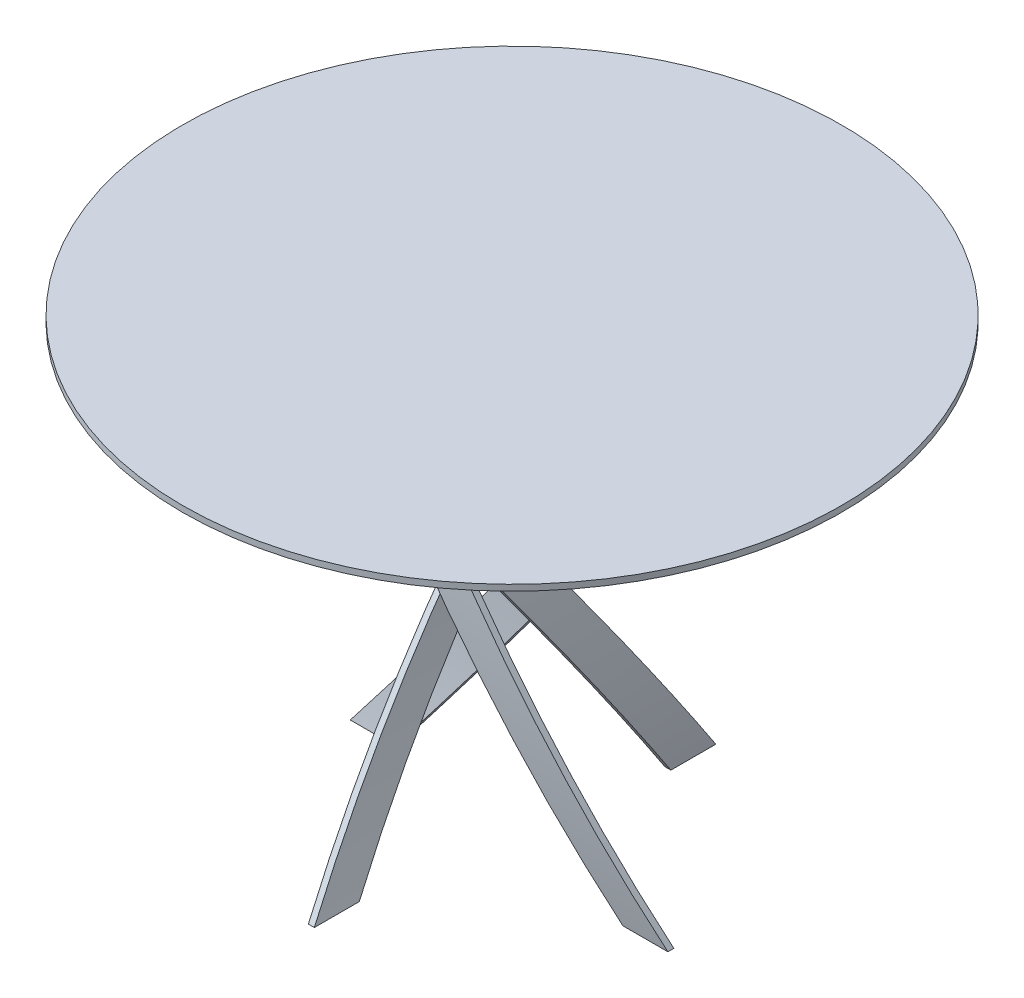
ISO-10303-21;
HEADER;
FILE_DESCRIPTION(('STEP AP214'),'2;1');
FILE_NAME('part.step','',(''),(''),'','','');
FILE_SCHEMA(('AUTOMOTIVE_DESIGN { 1 0 10303 214 1 1 1 1 }'));
ENDSEC;
DATA;
#1=APPLICATION_CONTEXT('core data for automotive mechanical design processes');
#2=APPLICATION_PROTOCOL_DEFINITION('international standard','automotive_design',2000,#1);
#3=PRODUCT_CONTEXT('',#1,'mechanical');
#4=PRODUCT('Part','Part','',(#3));
#5=PRODUCT_RELATED_PRODUCT_CATEGORY('part','',(#4));
#6=PRODUCT_DEFINITION_FORMATION('','',#4);
#7=PRODUCT_DEFINITION_CONTEXT('part definition',#1,'design');
#8=PRODUCT_DEFINITION('design','',#6,#7);
#9=PRODUCT_DEFINITION_SHAPE('','',#8);
#10=(LENGTH_UNIT() NAMED_UNIT(*) SI_UNIT(.MILLI.,.METRE.));
#11=(NAMED_UNIT(*) PLANE_ANGLE_UNIT() SI_UNIT($,.RADIAN.));
#12=(NAMED_UNIT(*) SI_UNIT($,.STERADIAN.) SOLID_ANGLE_UNIT());
#13=UNCERTAINTY_MEASURE_WITH_UNIT(LENGTH_MEASURE(1.E-05),#10,'distance_accuracy_value','');
#14=(GEOMETRIC_REPRESENTATION_CONTEXT(3) GLOBAL_UNCERTAINTY_ASSIGNED_CONTEXT((#13)) GLOBAL_UNIT_ASSIGNED_CONTEXT((#10,
#11,#12)) REPRESENTATION_CONTEXT('',''));
#15=CARTESIAN_POINT('',(0.,0.,0.));
#16=DIRECTION('',(0.,0.,1.));
#17=DIRECTION('',(1.,0.,0.));
#18=AXIS2_PLACEMENT_3D('',#15,#16,#17);
#19=CARTESIAN_POINT('',(-300.000000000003,-1.11022302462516E-13,299.999999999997));
#20=DIRECTION('',(0.,0.589469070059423,0.807790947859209));
#21=DIRECTION('',(0.,-0.807790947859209,0.589469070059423));
#22=AXIS2_PLACEMENT_3D('',#19,#20,#21);
#23=PLANE('',#22);
#24=DIRECTION('',(1.,0.,0.));
#25=VECTOR('',#24,1.);
#26=CARTESIAN_POINT('',(-299.999999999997,740.,-240.000000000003));
#27=LINE('',#26,#25);
#28=CARTESIAN_POINT('',(-39.9999999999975,740.,-240.));
#29=VERTEX_POINT('',#28);
#30=CARTESIAN_POINT('',(-29.9999999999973,740.,-240.));
#31=VERTEX_POINT('',#30);
#32=EDGE_CURVE('E109',#29,#31,#27,.T.);
#33=ORIENTED_EDGE('',*,*,#32,.F.);
#34=CARTESIAN_POINT('',(1721.56180703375,370.,30.0000000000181));
#35=DIRECTION('',(0.,0.589469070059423,0.807790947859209));
#36=DIRECTION('',(0.,0.807790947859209,-0.589469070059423));
#37=AXIS2_PLACEMENT_3D('',#34,#35,#36);
#38=ELLIPSE('',#37,2228.29929546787,1800.);
#39=CARTESIAN_POINT('',(-40.0000000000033,-1.11022302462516E-13,300.));
#40=VERTEX_POINT('',#39);
#41=EDGE_CURVE('E91',#29,#40,#38,.T.);
#42=ORIENTED_EDGE('',*,*,#41,.T.);
#43=DIRECTION('',(1.,0.,0.));
#44=VECTOR('',#43,1.);
#45=CARTESIAN_POINT('',(-300.000000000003,-1.11022302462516E-13,299.999999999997));
#46=LINE('',#45,#44);
#47=CARTESIAN_POINT('',(-30.0000000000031,-1.11022302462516E-13,300.));
#48=VERTEX_POINT('',#47);
#49=EDGE_CURVE('E111',#40,#48,#46,.T.);
#50=ORIENTED_EDGE('',*,*,#49,.T.);
#51=CARTESIAN_POINT('',(1731.56180703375,370.,30.0000000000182));
#52=DIRECTION('',(0.,0.589469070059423,0.807790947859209));
#53=DIRECTION('',(0.,0.807790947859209,-0.589469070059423));
#54=AXIS2_PLACEMENT_3D('',#51,#52,#53);
#55=ELLIPSE('',#54,2228.29929546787,1800.);
#56=EDGE_CURVE('E96',#48,#31,#55,.F.);
#57=ORIENTED_EDGE('',*,*,#56,.T.);
#58=EDGE_LOOP('',(#33,#42,#50,#57));
#59=FACE_BOUND('',#58,.T.);
#60=ADVANCED_FACE('F46',(#59),#23,.T.);
#61=CARTESIAN_POINT('',(1721.56180703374,370.,500.000000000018));
#62=DIRECTION('',(0.,0.,-1.));
#63=DIRECTION('',(-1.,0.,0.));
#64=AXIS2_PLACEMENT_3D('',#61,#62,#63);
#65=CYLINDRICAL_SURFACE('',#64,1800.);
#66=ORIENTED_EDGE('',*,*,#41,.F.);
#67=CARTESIAN_POINT('',(1721.56180703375,370.,-239.999999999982));
#68=DIRECTION('',(0.,0.,-1.));
#69=DIRECTION('',(0.,1.,0.));
#70=AXIS2_PLACEMENT_3D('',#67,#68,#69);
#71=CIRCLE('',#70,1800.);
#72=CARTESIAN_POINT('',(-58.4922044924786,637.222222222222,-240.000000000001));
#73=VERTEX_POINT('',#72);
#74=EDGE_CURVE('E87',#73,#29,#71,.T.);
#75=ORIENTED_EDGE('',*,*,#74,.F.);
#76=CARTESIAN_POINT('',(1721.56180703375,370.,-44.9999999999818));
#77=DIRECTION('',(0.,-0.589469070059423,-0.807790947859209));
#78=DIRECTION('',(0.,0.807790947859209,-0.589469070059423));
#79=AXIS2_PLACEMENT_3D('',#76,#77,#78);
#80=ELLIPSE('',#79,2228.29929546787,1800.);
#81=CARTESIAN_POINT('',(-40.0000000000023,-1.11022302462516E-13,225.));
#82=VERTEX_POINT('',#81);
#83=EDGE_CURVE('E50',#82,#73,#80,.T.);
#84=ORIENTED_EDGE('',*,*,#83,.F.);
#85=DIRECTION('',(0.,0.,-1.));
#86=VECTOR('',#85,1.);
#87=CARTESIAN_POINT('',(-40.0000000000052,0.,500.));
#88=LINE('',#87,#86);
#89=EDGE_CURVE('E70',#40,#82,#88,.T.);
#90=ORIENTED_EDGE('',*,*,#89,.F.);
#91=EDGE_LOOP('',(#66,#75,#84,#90));
#92=FACE_BOUND('',#91,.T.);
#93=ADVANCED_FACE('F89',(#92),#65,.T.);
#94=CARTESIAN_POINT('',(-299.999999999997,637.222222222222,-240.000000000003));
#95=DIRECTION('',(0.,-0.589469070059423,-0.807790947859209));
#96=DIRECTION('',(0.,0.807790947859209,-0.589469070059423));
#97=AXIS2_PLACEMENT_3D('',#94,#95,#96);
#98=PLANE('',#97);
#99=DIRECTION('',(1.,0.,0.));
#100=VECTOR('',#99,1.);
#101=CARTESIAN_POINT('',(-300.000000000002,-1.11022302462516E-13,224.999999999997));
#102=LINE('',#101,#100);
#103=CARTESIAN_POINT('',(-30.0000000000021,-1.11022302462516E-13,225.));
#104=VERTEX_POINT('',#103);
#105=EDGE_CURVE('E12',#82,#104,#102,.T.);
#106=ORIENTED_EDGE('',*,*,#105,.F.);
#107=ORIENTED_EDGE('',*,*,#83,.T.);
#108=DIRECTION('',(1.,0.,0.));
#109=VECTOR('',#108,1.);
#110=CARTESIAN_POINT('',(-299.999999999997,637.222222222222,-240.000000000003));
#111=LINE('',#110,#109);
#112=CARTESIAN_POINT('',(-48.4922044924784,637.222222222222,-240.));
#113=VERTEX_POINT('',#112);
#114=EDGE_CURVE('E55',#73,#113,#111,.T.);
#115=ORIENTED_EDGE('',*,*,#114,.T.);
#116=CARTESIAN_POINT('',(1731.56180703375,370.,-44.9999999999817));
#117=DIRECTION('',(0.,-0.589469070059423,-0.807790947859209));
#118=DIRECTION('',(0.,0.807790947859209,-0.589469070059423));
#119=AXIS2_PLACEMENT_3D('',#116,#117,#118);
#120=ELLIPSE('',#119,2228.29929546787,1800.);
#121=EDGE_CURVE('E101',#113,#104,#120,.F.);
#122=ORIENTED_EDGE('',*,*,#121,.T.);
#123=EDGE_LOOP('',(#106,#107,#115,#122));
#124=FACE_BOUND('',#123,.T.);
#125=ADVANCED_FACE('F48',(#124),#98,.T.);
#126=CARTESIAN_POINT('',(-299.999999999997,740.,-240.000000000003));
#127=DIRECTION('',(0.,0.,-1.));
#128=DIRECTION('',(0.,1.,0.));
#129=AXIS2_PLACEMENT_3D('',#126,#127,#128);
#130=PLANE('',#129);
#131=ORIENTED_EDGE('',*,*,#114,.F.);
#132=ORIENTED_EDGE('',*,*,#74,.T.);
#133=ORIENTED_EDGE('',*,*,#32,.T.);
#134=CARTESIAN_POINT('',(1731.56180703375,370.,-239.999999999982));
#135=DIRECTION('',(0.,0.,-1.));
#136=DIRECTION('',(0.,1.,0.));
#137=AXIS2_PLACEMENT_3D('',#134,#135,#136);
#138=CIRCLE('',#137,1800.);
#139=EDGE_CURVE('E97',#31,#113,#138,.F.);
#140=ORIENTED_EDGE('',*,*,#139,.T.);
#141=EDGE_LOOP('',(#131,#132,#133,#140));
#142=FACE_BOUND('',#141,.T.);
#143=ADVANCED_FACE('F102',(#142),#130,.T.);
#144=CARTESIAN_POINT('',(1731.56180703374,370.,500.000000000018));
#145=DIRECTION('',(0.,0.,-1.));
#146=DIRECTION('',(-1.,0.,0.));
#147=AXIS2_PLACEMENT_3D('',#144,#145,#146);
#148=CYLINDRICAL_SURFACE('',#147,1800.);
#149=ORIENTED_EDGE('',*,*,#56,.F.);
#150=DIRECTION('',(0.,0.,-1.));
#151=VECTOR('',#150,1.);
#152=CARTESIAN_POINT('',(-30.0000000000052,0.,500.));
#153=LINE('',#152,#151);
#154=EDGE_CURVE('E62',#48,#104,#153,.T.);
#155=ORIENTED_EDGE('',*,*,#154,.T.);
#156=ORIENTED_EDGE('',*,*,#121,.F.);
#157=ORIENTED_EDGE('',*,*,#139,.F.);
#158=EDGE_LOOP('',(#149,#155,#156,#157));
#159=FACE_BOUND('',#158,.T.);
#160=ADVANCED_FACE('F122',(#159),#148,.F.);
#161=CARTESIAN_POINT('',(-300.000000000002,-1.11022302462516E-13,224.999999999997));
#162=DIRECTION('',(0.,-1.,0.));
#163=DIRECTION('',(-1.,0.,0.));
#164=AXIS2_PLACEMENT_3D('',#161,#162,#163);
#165=PLANE('',#164);
#166=ORIENTED_EDGE('',*,*,#49,.F.);
#167=ORIENTED_EDGE('',*,*,#89,.T.);
#168=ORIENTED_EDGE('',*,*,#105,.T.);
#169=ORIENTED_EDGE('',*,*,#154,.F.);
#170=EDGE_LOOP('',(#166,#167,#168,#169));
#171=FACE_BOUND('',#170,.T.);
#172=ADVANCED_FACE('F119',(#171),#165,.T.);
#173=CLOSED_SHELL('',(#60,#93,#125,#143,#160,#172));
#174=MANIFOLD_SOLID_BREP('B2',#173);
#175=CARTESIAN_POINT('',(300.,-1.11022302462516E-13,300.));
#176=DIRECTION('',(0.807790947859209,0.589469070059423,0.));
#177=DIRECTION('',(0.589469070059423,-0.807790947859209,0.));
#178=AXIS2_PLACEMENT_3D('',#175,#176,#177);
#179=PLANE('',#178);
#180=DIRECTION('',(0.,0.,-1.));
#181=VECTOR('',#180,1.);
#182=CARTESIAN_POINT('',(-240.,740.,300.));
#183=LINE('',#182,#181);
#184=CARTESIAN_POINT('',(-240.,740.,40.));
#185=VERTEX_POINT('',#184);
#186=CARTESIAN_POINT('',(-240.,740.,29.9999999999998));
#187=VERTEX_POINT('',#186);
#188=EDGE_CURVE('E255',#185,#187,#183,.T.);
#189=ORIENTED_EDGE('',*,*,#188,.F.);
#190=CARTESIAN_POINT('',(30.,370.,-1721.56180703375));
#191=DIRECTION('',(0.807790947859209,0.589469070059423,0.));
#192=DIRECTION('',(-0.589469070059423,0.807790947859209,0.));
#193=AXIS2_PLACEMENT_3D('',#190,#191,#192);
#194=ELLIPSE('',#193,2228.29929546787,1800.);
#195=CARTESIAN_POINT('',(300.,-1.11022302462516E-13,40.0000000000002));
#196=VERTEX_POINT('',#195);
#197=EDGE_CURVE('E237',#185,#196,#194,.T.);
#198=ORIENTED_EDGE('',*,*,#197,.T.);
#199=DIRECTION('',(0.,0.,-1.));
#200=VECTOR('',#199,1.);
#201=CARTESIAN_POINT('',(300.,-1.11022302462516E-13,300.));
#202=LINE('',#201,#200);
#203=CARTESIAN_POINT('',(300.,-1.11022302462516E-13,30.));
#204=VERTEX_POINT('',#203);
#205=EDGE_CURVE('E257',#196,#204,#202,.T.);
#206=ORIENTED_EDGE('',*,*,#205,.T.);
#207=CARTESIAN_POINT('',(30.,370.,-1731.56180703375));
#208=DIRECTION('',(0.807790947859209,0.589469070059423,0.));
#209=DIRECTION('',(-0.589469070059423,0.807790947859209,0.));
#210=AXIS2_PLACEMENT_3D('',#207,#208,#209);
#211=ELLIPSE('',#210,2228.29929546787,1800.);
#212=EDGE_CURVE('E242',#204,#187,#211,.F.);
#213=ORIENTED_EDGE('',*,*,#212,.T.);
#214=EDGE_LOOP('',(#189,#198,#206,#213));
#215=FACE_BOUND('',#214,.T.);
#216=ADVANCED_FACE('F192',(#215),#179,.T.);
#217=CARTESIAN_POINT('',(500.,370.,-1721.56180703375));
#218=DIRECTION('',(-1.,0.,0.));
#219=DIRECTION('',(0.,0.,1.));
#220=AXIS2_PLACEMENT_3D('',#217,#218,#219);
#221=CYLINDRICAL_SURFACE('',#220,1800.);
#222=ORIENTED_EDGE('',*,*,#197,.F.);
#223=CARTESIAN_POINT('',(-240.,370.,-1721.56180703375));
#224=DIRECTION('',(-1.,0.,0.));
#225=DIRECTION('',(0.,1.,0.));
#226=AXIS2_PLACEMENT_3D('',#223,#224,#225);
#227=CIRCLE('',#226,1800.);
#228=CARTESIAN_POINT('',(-240.,637.222222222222,58.4922044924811));
#229=VERTEX_POINT('',#228);
#230=EDGE_CURVE('E233',#229,#185,#227,.T.);
#231=ORIENTED_EDGE('',*,*,#230,.F.);
#232=CARTESIAN_POINT('',(-44.9999999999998,370.,-1721.56180703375));
#233=DIRECTION('',(-0.807790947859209,-0.589469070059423,0.));
#234=DIRECTION('',(-0.589469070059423,0.807790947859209,0.));
#235=AXIS2_PLACEMENT_3D('',#232,#233,#234);
#236=ELLIPSE('',#235,2228.29929546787,1800.);
#237=CARTESIAN_POINT('',(225.,-1.11022302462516E-13,40.));
#238=VERTEX_POINT('',#237);
#239=EDGE_CURVE('E196',#238,#229,#236,.T.);
#240=ORIENTED_EDGE('',*,*,#239,.F.);
#241=DIRECTION('',(-1.,0.,0.));
#242=VECTOR('',#241,1.);
#243=CARTESIAN_POINT('',(500.,0.,40.));
#244=LINE('',#243,#242);
#245=EDGE_CURVE('E216',#196,#238,#244,.T.);
#246=ORIENTED_EDGE('',*,*,#245,.F.);
#247=EDGE_LOOP('',(#222,#231,#240,#246));
#248=FACE_BOUND('',#247,.T.);
#249=ADVANCED_FACE('F235',(#248),#221,.T.);
#250=CARTESIAN_POINT('',(-240.,637.222222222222,300.));
#251=DIRECTION('',(-0.807790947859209,-0.589469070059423,0.));
#252=DIRECTION('',(-0.589469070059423,0.807790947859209,0.));
#253=AXIS2_PLACEMENT_3D('',#250,#251,#252);
#254=PLANE('',#253);
#255=DIRECTION('',(0.,0.,-1.));
#256=VECTOR('',#255,1.);
#257=CARTESIAN_POINT('',(225.,-1.11022302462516E-13,300.));
#258=LINE('',#257,#256);
#259=CARTESIAN_POINT('',(225.,-1.11022302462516E-13,29.9999999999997));
#260=VERTEX_POINT('',#259);
#261=EDGE_CURVE('E44',#238,#260,#258,.T.);
#262=ORIENTED_EDGE('',*,*,#261,.F.);
#263=ORIENTED_EDGE('',*,*,#239,.T.);
#264=DIRECTION('',(0.,0.,-1.));
#265=VECTOR('',#264,1.);
#266=CARTESIAN_POINT('',(-240.,637.222222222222,300.));
#267=LINE('',#266,#265);
#268=CARTESIAN_POINT('',(-240.,637.222222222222,48.4922044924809));
#269=VERTEX_POINT('',#268);
#270=EDGE_CURVE('E201',#229,#269,#267,.T.);
#271=ORIENTED_EDGE('',*,*,#270,.T.);
#272=CARTESIAN_POINT('',(-44.9999999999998,370.,-1731.56180703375));
#273=DIRECTION('',(-0.807790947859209,-0.589469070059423,0.));
#274=DIRECTION('',(-0.589469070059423,0.807790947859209,0.));
#275=AXIS2_PLACEMENT_3D('',#272,#273,#274);
#276=ELLIPSE('',#275,2228.29929546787,1800.);
#277=EDGE_CURVE('E247',#269,#260,#276,.F.);
#278=ORIENTED_EDGE('',*,*,#277,.T.);
#279=EDGE_LOOP('',(#262,#263,#271,#278));
#280=FACE_BOUND('',#279,.T.);
#281=ADVANCED_FACE('F194',(#280),#254,.T.);
#282=CARTESIAN_POINT('',(-240.,740.,300.));
#283=DIRECTION('',(-1.,0.,0.));
#284=DIRECTION('',(0.,1.,0.));
#285=AXIS2_PLACEMENT_3D('',#282,#283,#284);
#286=PLANE('',#285);
#287=ORIENTED_EDGE('',*,*,#270,.F.);
#288=ORIENTED_EDGE('',*,*,#230,.T.);
#289=ORIENTED_EDGE('',*,*,#188,.T.);
#290=CARTESIAN_POINT('',(-240.,370.,-1731.56180703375));
#291=DIRECTION('',(-1.,0.,0.));
#292=DIRECTION('',(0.,1.,0.));
#293=AXIS2_PLACEMENT_3D('',#290,#291,#292);
#294=CIRCLE('',#293,1800.);
#295=EDGE_CURVE('E243',#187,#269,#294,.F.);
#296=ORIENTED_EDGE('',*,*,#295,.T.);
#297=EDGE_LOOP('',(#287,#288,#289,#296));
#298=FACE_BOUND('',#297,.T.);
#299=ADVANCED_FACE('F248',(#298),#286,.T.);
#300=CARTESIAN_POINT('',(500.,370.,-1731.56180703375));
#301=DIRECTION('',(-1.,0.,0.));
#302=DIRECTION('',(0.,0.,1.));
#303=AXIS2_PLACEMENT_3D('',#300,#301,#302);
#304=CYLINDRICAL_SURFACE('',#303,1800.);
#305=ORIENTED_EDGE('',*,*,#212,.F.);
#306=DIRECTION('',(-1.,0.,0.));
#307=VECTOR('',#306,1.);
#308=CARTESIAN_POINT('',(500.,0.,30.));
#309=LINE('',#308,#307);
#310=EDGE_CURVE('E208',#204,#260,#309,.T.);
#311=ORIENTED_EDGE('',*,*,#310,.T.);
#312=ORIENTED_EDGE('',*,*,#277,.F.);
#313=ORIENTED_EDGE('',*,*,#295,.F.);
#314=EDGE_LOOP('',(#305,#311,#312,#313));
#315=FACE_BOUND('',#314,.T.);
#316=ADVANCED_FACE('F268',(#315),#304,.F.);
#317=CARTESIAN_POINT('',(225.,-1.11022302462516E-13,300.));
#318=DIRECTION('',(0.,-1.,0.));
#319=DIRECTION('',(0.,0.,1.));
#320=AXIS2_PLACEMENT_3D('',#317,#318,#319);
#321=PLANE('',#320);
#322=ORIENTED_EDGE('',*,*,#205,.F.);
#323=ORIENTED_EDGE('',*,*,#245,.T.);
#324=ORIENTED_EDGE('',*,*,#261,.T.);
#325=ORIENTED_EDGE('',*,*,#310,.F.);
#326=EDGE_LOOP('',(#322,#323,#324,#325));
#327=FACE_BOUND('',#326,.T.);
#328=ADVANCED_FACE('F265',(#327),#321,.T.);
#329=CLOSED_SHELL('',(#216,#249,#281,#299,#316,#328));
#330=MANIFOLD_SOLID_BREP('B6',#329);
#331=CARTESIAN_POINT('',(300.000000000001,-1.11022302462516E-13,-299.999999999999));
#332=DIRECTION('',(0.,0.589469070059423,-0.807790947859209));
#333=DIRECTION('',(0.,-0.807790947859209,-0.589469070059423));
#334=AXIS2_PLACEMENT_3D('',#331,#332,#333);
#335=PLANE('',#334);
#336=DIRECTION('',(-1.,0.,0.));
#337=VECTOR('',#336,1.);
#338=CARTESIAN_POINT('',(299.999999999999,740.,240.000000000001));
#339=LINE('',#338,#337);
#340=CARTESIAN_POINT('',(39.9999999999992,740.,240.));
#341=VERTEX_POINT('',#340);
#342=CARTESIAN_POINT('',(29.999999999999,740.,240.));
#343=VERTEX_POINT('',#342);
#344=EDGE_CURVE('E401',#341,#343,#339,.T.);
#345=ORIENTED_EDGE('',*,*,#344,.F.);
#346=CARTESIAN_POINT('',(-1721.56180703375,370.,-30.000000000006));
#347=DIRECTION('',(0.,0.589469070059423,-0.807790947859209));
#348=DIRECTION('',(0.,0.807790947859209,0.589469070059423));
#349=AXIS2_PLACEMENT_3D('',#346,#347,#348);
#350=ELLIPSE('',#349,2228.29929546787,1800.);
#351=CARTESIAN_POINT('',(40.0000000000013,-1.11022302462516E-13,-300.));
#352=VERTEX_POINT('',#351);
#353=EDGE_CURVE('E383',#341,#352,#350,.T.);
#354=ORIENTED_EDGE('',*,*,#353,.T.);
#355=DIRECTION('',(-1.,0.,0.));
#356=VECTOR('',#355,1.);
#357=CARTESIAN_POINT('',(300.000000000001,-1.11022302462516E-13,-299.999999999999));
#358=LINE('',#357,#356);
#359=CARTESIAN_POINT('',(30.000000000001,-1.11022302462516E-13,-300.));
#360=VERTEX_POINT('',#359);
#361=EDGE_CURVE('E403',#352,#360,#358,.T.);
#362=ORIENTED_EDGE('',*,*,#361,.T.);
#363=CARTESIAN_POINT('',(-1731.56180703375,370.,-30.0000000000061));
#364=DIRECTION('',(0.,0.589469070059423,-0.807790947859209));
#365=DIRECTION('',(0.,0.807790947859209,0.589469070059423));
#366=AXIS2_PLACEMENT_3D('',#363,#364,#365);
#367=ELLIPSE('',#366,2228.29929546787,1800.);
#368=EDGE_CURVE('E388',#360,#343,#367,.F.);
#369=ORIENTED_EDGE('',*,*,#368,.T.);
#370=EDGE_LOOP('',(#345,#354,#362,#369));
#371=FACE_BOUND('',#370,.T.);
#372=ADVANCED_FACE('F338',(#371),#335,.T.);
#373=CARTESIAN_POINT('',(-1721.56180703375,370.,-500.000000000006));
#374=DIRECTION('',(0.,0.,1.));
#375=DIRECTION('',(1.,0.,0.));
#376=AXIS2_PLACEMENT_3D('',#373,#374,#375);
#377=CYLINDRICAL_SURFACE('',#376,1800.);
#378=ORIENTED_EDGE('',*,*,#353,.F.);
#379=CARTESIAN_POINT('',(-1721.56180703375,370.,239.999999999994));
#380=DIRECTION('',(0.,0.,1.));
#381=DIRECTION('',(0.,1.,0.));
#382=AXIS2_PLACEMENT_3D('',#379,#380,#381);
#383=CIRCLE('',#382,1800.);
#384=CARTESIAN_POINT('',(58.4922044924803,637.222222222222,240.));
#385=VERTEX_POINT('',#384);
#386=EDGE_CURVE('E379',#385,#341,#383,.T.);
#387=ORIENTED_EDGE('',*,*,#386,.F.);
#388=CARTESIAN_POINT('',(-1721.56180703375,370.,44.9999999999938));
#389=DIRECTION('',(0.,-0.589469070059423,0.807790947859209));
#390=DIRECTION('',(0.,0.807790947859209,0.589469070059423));
#391=AXIS2_PLACEMENT_3D('',#388,#389,#390);
#392=ELLIPSE('',#391,2228.29929546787,1800.);
#393=CARTESIAN_POINT('',(40.0000000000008,-1.11022302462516E-13,-225.));
#394=VERTEX_POINT('',#393);
#395=EDGE_CURVE('E342',#394,#385,#392,.T.);
#396=ORIENTED_EDGE('',*,*,#395,.F.);
#397=DIRECTION('',(0.,0.,1.));
#398=VECTOR('',#397,1.);
#399=CARTESIAN_POINT('',(40.0000000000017,0.,-500.));
#400=LINE('',#399,#398);
#401=EDGE_CURVE('E362',#352,#394,#400,.T.);
#402=ORIENTED_EDGE('',*,*,#401,.F.);
#403=EDGE_LOOP('',(#378,#387,#396,#402));
#404=FACE_BOUND('',#403,.T.);
#405=ADVANCED_FACE('F381',(#404),#377,.T.);
#406=CARTESIAN_POINT('',(299.999999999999,637.222222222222,240.000000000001));
#407=DIRECTION('',(0.,-0.589469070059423,0.807790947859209));
#408=DIRECTION('',(0.,0.807790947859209,0.589469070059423));
#409=AXIS2_PLACEMENT_3D('',#406,#407,#408);
#410=PLANE('',#409);
#411=DIRECTION('',(-1.,0.,0.));
#412=VECTOR('',#411,1.);
#413=CARTESIAN_POINT('',(300.000000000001,-1.11022302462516E-13,-224.999999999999));
#414=LINE('',#413,#412);
#415=CARTESIAN_POINT('',(30.0000000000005,-1.11022302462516E-13,-225.));
#416=VERTEX_POINT('',#415);
#417=EDGE_CURVE('E190',#394,#416,#414,.T.);
#418=ORIENTED_EDGE('',*,*,#417,.F.);
#419=ORIENTED_EDGE('',*,*,#395,.T.);
#420=DIRECTION('',(-1.,0.,0.));
#421=VECTOR('',#420,1.);
#422=CARTESIAN_POINT('',(299.999999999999,637.222222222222,240.000000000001));
#423=LINE('',#422,#421);
#424=CARTESIAN_POINT('',(48.49220449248,637.222222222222,240.));
#425=VERTEX_POINT('',#424);
#426=EDGE_CURVE('E347',#385,#425,#423,.T.);
#427=ORIENTED_EDGE('',*,*,#426,.T.);
#428=CARTESIAN_POINT('',(-1731.56180703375,370.,44.9999999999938));
#429=DIRECTION('',(0.,-0.589469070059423,0.807790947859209));
#430=DIRECTION('',(0.,0.807790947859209,0.589469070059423));
#431=AXIS2_PLACEMENT_3D('',#428,#429,#430);
#432=ELLIPSE('',#431,2228.29929546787,1800.);
#433=EDGE_CURVE('E393',#425,#416,#432,.F.);
#434=ORIENTED_EDGE('',*,*,#433,.T.);
#435=EDGE_LOOP('',(#418,#419,#427,#434));
#436=FACE_BOUND('',#435,.T.);
#437=ADVANCED_FACE('F340',(#436),#410,.T.);
#438=CARTESIAN_POINT('',(299.999999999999,740.,240.000000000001));
#439=DIRECTION('',(0.,0.,1.));
#440=DIRECTION('',(0.,1.,0.));
#441=AXIS2_PLACEMENT_3D('',#438,#439,#440);
#442=PLANE('',#441);
#443=ORIENTED_EDGE('',*,*,#426,.F.);
#444=ORIENTED_EDGE('',*,*,#386,.T.);
#445=ORIENTED_EDGE('',*,*,#344,.T.);
#446=CARTESIAN_POINT('',(-1731.56180703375,370.,239.999999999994));
#447=DIRECTION('',(0.,0.,1.));
#448=DIRECTION('',(0.,1.,0.));
#449=AXIS2_PLACEMENT_3D('',#446,#447,#448);
#450=CIRCLE('',#449,1800.);
#451=EDGE_CURVE('E389',#343,#425,#450,.F.);
#452=ORIENTED_EDGE('',*,*,#451,.T.);
#453=EDGE_LOOP('',(#443,#444,#445,#452));
#454=FACE_BOUND('',#453,.T.);
#455=ADVANCED_FACE('F394',(#454),#442,.T.);
#456=CARTESIAN_POINT('',(-1731.56180703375,370.,-500.000000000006));
#457=DIRECTION('',(0.,0.,1.));
#458=DIRECTION('',(1.,0.,0.));
#459=AXIS2_PLACEMENT_3D('',#456,#457,#458);
#460=CYLINDRICAL_SURFACE('',#459,1800.);
#461=ORIENTED_EDGE('',*,*,#368,.F.);
#462=DIRECTION('',(0.,0.,1.));
#463=VECTOR('',#462,1.);
#464=CARTESIAN_POINT('',(30.0000000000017,0.,-500.));
#465=LINE('',#464,#463);
#466=EDGE_CURVE('E354',#360,#416,#465,.T.);
#467=ORIENTED_EDGE('',*,*,#466,.T.);
#468=ORIENTED_EDGE('',*,*,#433,.F.);
#469=ORIENTED_EDGE('',*,*,#451,.F.);
#470=EDGE_LOOP('',(#461,#467,#468,#469));
#471=FACE_BOUND('',#470,.T.);
#472=ADVANCED_FACE('F414',(#471),#460,.F.);
#473=CARTESIAN_POINT('',(300.000000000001,-1.11022302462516E-13,-224.999999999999));
#474=DIRECTION('',(0.,-1.,0.));
#475=DIRECTION('',(1.,0.,0.));
#476=AXIS2_PLACEMENT_3D('',#473,#474,#475);
#477=PLANE('',#476);
#478=ORIENTED_EDGE('',*,*,#361,.F.);
#479=ORIENTED_EDGE('',*,*,#401,.T.);
#480=ORIENTED_EDGE('',*,*,#417,.T.);
#481=ORIENTED_EDGE('',*,*,#466,.F.);
#482=EDGE_LOOP('',(#478,#479,#480,#481));
#483=FACE_BOUND('',#482,.T.);
#484=ADVANCED_FACE('F411',(#483),#477,.T.);
#485=CLOSED_SHELL('',(#372,#405,#437,#455,#472,#484));
#486=MANIFOLD_SOLID_BREP('B38',#485);
#487=CARTESIAN_POINT('',(-300.,-1.11022302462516E-13,-300.));
#488=DIRECTION('',(-0.807790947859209,0.589469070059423,0.));
#489=DIRECTION('',(-0.589469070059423,-0.807790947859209,0.));
#490=AXIS2_PLACEMENT_3D('',#487,#488,#489);
#491=PLANE('',#490);
#492=DIRECTION('',(0.,0.,1.));
#493=VECTOR('',#492,1.);
#494=CARTESIAN_POINT('',(240.,740.,-300.));
#495=LINE('',#494,#493);
#496=CARTESIAN_POINT('',(240.,740.,-40.));
#497=VERTEX_POINT('',#496);
#498=CARTESIAN_POINT('',(240.,740.,-29.9999999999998));
#499=VERTEX_POINT('',#498);
#500=EDGE_CURVE('E544',#497,#499,#495,.T.);
#501=ORIENTED_EDGE('',*,*,#500,.F.);
#502=CARTESIAN_POINT('',(-30.,370.,1721.56180703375));
#503=DIRECTION('',(-0.807790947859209,0.589469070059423,0.));
#504=DIRECTION('',(0.589469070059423,0.807790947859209,0.));
#505=AXIS2_PLACEMENT_3D('',#502,#503,#504);
#506=ELLIPSE('',#505,2228.29929546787,1800.);
#507=CARTESIAN_POINT('',(-300.,-1.11022302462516E-13,-40.0000000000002));
#508=VERTEX_POINT('',#507);
#509=EDGE_CURVE('E526',#497,#508,#506,.T.);
#510=ORIENTED_EDGE('',*,*,#509,.T.);
#511=DIRECTION('',(0.,0.,1.));
#512=VECTOR('',#511,1.);
#513=CARTESIAN_POINT('',(-300.,-1.11022302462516E-13,-300.));
#514=LINE('',#513,#512);
#515=CARTESIAN_POINT('',(-300.,-1.11022302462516E-13,-30.));
#516=VERTEX_POINT('',#515);
#517=EDGE_CURVE('E546',#508,#516,#514,.T.);
#518=ORIENTED_EDGE('',*,*,#517,.T.);
#519=CARTESIAN_POINT('',(-30.,370.,1731.56180703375));
#520=DIRECTION('',(-0.807790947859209,0.589469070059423,0.));
#521=DIRECTION('',(0.589469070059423,0.807790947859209,0.));
#522=AXIS2_PLACEMENT_3D('',#519,#520,#521);
#523=ELLIPSE('',#522,2228.29929546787,1800.);
#524=EDGE_CURVE('E531',#516,#499,#523,.F.);
#525=ORIENTED_EDGE('',*,*,#524,.T.);
#526=EDGE_LOOP('',(#501,#510,#518,#525));
#527=FACE_BOUND('',#526,.T.);
#528=ADVANCED_FACE('F481',(#527),#491,.T.);
#529=CARTESIAN_POINT('',(-500.,370.,1721.56180703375));
#530=DIRECTION('',(1.,0.,0.));
#531=DIRECTION('',(0.,0.,-1.));
#532=AXIS2_PLACEMENT_3D('',#529,#530,#531);
#533=CYLINDRICAL_SURFACE('',#532,1800.);
#534=ORIENTED_EDGE('',*,*,#509,.F.);
#535=CARTESIAN_POINT('',(240.,370.,1721.56180703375));
#536=DIRECTION('',(1.,0.,0.));
#537=DIRECTION('',(0.,1.,0.));
#538=AXIS2_PLACEMENT_3D('',#535,#536,#537);
#539=CIRCLE('',#538,1800.);
#540=CARTESIAN_POINT('',(240.,637.222222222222,-58.4922044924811));
#541=VERTEX_POINT('',#540);
#542=EDGE_CURVE('E522',#541,#497,#539,.T.);
#543=ORIENTED_EDGE('',*,*,#542,.F.);
#544=CARTESIAN_POINT('',(44.9999999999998,370.,1721.56180703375));
#545=DIRECTION('',(0.807790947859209,-0.589469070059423,0.));
#546=DIRECTION('',(0.589469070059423,0.807790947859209,0.));
#547=AXIS2_PLACEMENT_3D('',#544,#545,#546);
#548=ELLIPSE('',#547,2228.29929546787,1800.);
#549=CARTESIAN_POINT('',(-225.,-1.11022302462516E-13,-40.));
#550=VERTEX_POINT('',#549);
#551=EDGE_CURVE('E485',#550,#541,#548,.T.);
#552=ORIENTED_EDGE('',*,*,#551,.F.);
#553=DIRECTION('',(1.,0.,0.));
#554=VECTOR('',#553,1.);
#555=CARTESIAN_POINT('',(-500.,0.,-40.));
#556=LINE('',#555,#554);
#557=EDGE_CURVE('E505',#508,#550,#556,.T.);
#558=ORIENTED_EDGE('',*,*,#557,.F.);
#559=EDGE_LOOP('',(#534,#543,#552,#558));
#560=FACE_BOUND('',#559,.T.);
#561=ADVANCED_FACE('F524',(#560),#533,.T.);
#562=CARTESIAN_POINT('',(240.,637.222222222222,-300.));
#563=DIRECTION('',(0.807790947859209,-0.589469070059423,0.));
#564=DIRECTION('',(0.589469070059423,0.807790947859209,0.));
#565=AXIS2_PLACEMENT_3D('',#562,#563,#564);
#566=PLANE('',#565);
#567=DIRECTION('',(0.,0.,1.));
#568=VECTOR('',#567,1.);
#569=CARTESIAN_POINT('',(-225.,-1.11022302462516E-13,-300.));
#570=LINE('',#569,#568);
#571=CARTESIAN_POINT('',(-225.,-1.11022302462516E-13,-29.9999999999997));
#572=VERTEX_POINT('',#571);
#573=EDGE_CURVE('E336',#550,#572,#570,.T.);
#574=ORIENTED_EDGE('',*,*,#573,.F.);
#575=ORIENTED_EDGE('',*,*,#551,.T.);
#576=DIRECTION('',(0.,0.,1.));
#577=VECTOR('',#576,1.);
#578=CARTESIAN_POINT('',(240.,637.222222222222,-300.));
#579=LINE('',#578,#577);
#580=CARTESIAN_POINT('',(240.,637.222222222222,-48.4922044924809));
#581=VERTEX_POINT('',#580);
#582=EDGE_CURVE('E490',#541,#581,#579,.T.);
#583=ORIENTED_EDGE('',*,*,#582,.T.);
#584=CARTESIAN_POINT('',(44.9999999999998,370.,1731.56180703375));
#585=DIRECTION('',(0.807790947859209,-0.589469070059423,0.));
#586=DIRECTION('',(0.589469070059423,0.807790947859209,0.));
#587=AXIS2_PLACEMENT_3D('',#584,#585,#586);
#588=ELLIPSE('',#587,2228.29929546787,1800.);
#589=EDGE_CURVE('E536',#581,#572,#588,.F.);
#590=ORIENTED_EDGE('',*,*,#589,.T.);
#591=EDGE_LOOP('',(#574,#575,#583,#590));
#592=FACE_BOUND('',#591,.T.);
#593=ADVANCED_FACE('F483',(#592),#566,.T.);
#594=CARTESIAN_POINT('',(240.,740.,-300.));
#595=DIRECTION('',(1.,0.,0.));
#596=DIRECTION('',(0.,1.,0.));
#597=AXIS2_PLACEMENT_3D('',#594,#595,#596);
#598=PLANE('',#597);
#599=ORIENTED_EDGE('',*,*,#582,.F.);
#600=ORIENTED_EDGE('',*,*,#542,.T.);
#601=ORIENTED_EDGE('',*,*,#500,.T.);
#602=CARTESIAN_POINT('',(240.,370.,1731.56180703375));
#603=DIRECTION('',(1.,0.,0.));
#604=DIRECTION('',(0.,1.,0.));
#605=AXIS2_PLACEMENT_3D('',#602,#603,#604);
#606=CIRCLE('',#605,1800.);
#607=EDGE_CURVE('E532',#499,#581,#606,.F.);
#608=ORIENTED_EDGE('',*,*,#607,.T.);
#609=EDGE_LOOP('',(#599,#600,#601,#608));
#610=FACE_BOUND('',#609,.T.);
#611=ADVANCED_FACE('F537',(#610),#598,.T.);
#612=CARTESIAN_POINT('',(-500.,370.,1731.56180703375));
#613=DIRECTION('',(1.,0.,0.));
#614=DIRECTION('',(0.,0.,-1.));
#615=AXIS2_PLACEMENT_3D('',#612,#613,#614);
#616=CYLINDRICAL_SURFACE('',#615,1800.);
#617=ORIENTED_EDGE('',*,*,#524,.F.);
#618=DIRECTION('',(1.,0.,0.));
#619=VECTOR('',#618,1.);
#620=CARTESIAN_POINT('',(-500.,0.,-30.));
#621=LINE('',#620,#619);
#622=EDGE_CURVE('E497',#516,#572,#621,.T.);
#623=ORIENTED_EDGE('',*,*,#622,.T.);
#624=ORIENTED_EDGE('',*,*,#589,.F.);
#625=ORIENTED_EDGE('',*,*,#607,.F.);
#626=EDGE_LOOP('',(#617,#623,#624,#625));
#627=FACE_BOUND('',#626,.T.);
#628=ADVANCED_FACE('F557',(#627),#616,.F.);
#629=CARTESIAN_POINT('',(-225.,-1.11022302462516E-13,-300.));
#630=DIRECTION('',(0.,-1.,0.));
#631=DIRECTION('',(0.,0.,-1.));
#632=AXIS2_PLACEMENT_3D('',#629,#630,#631);
#633=PLANE('',#632);
#634=ORIENTED_EDGE('',*,*,#517,.F.);
#635=ORIENTED_EDGE('',*,*,#557,.T.);
#636=ORIENTED_EDGE('',*,*,#573,.T.);
#637=ORIENTED_EDGE('',*,*,#622,.F.);
#638=EDGE_LOOP('',(#634,#635,#636,#637));
#639=FACE_BOUND('',#638,.T.);
#640=ADVANCED_FACE('F554',(#639),#633,.T.);
#641=CLOSED_SHELL('',(#528,#561,#593,#611,#628,#640));
#642=MANIFOLD_SOLID_BREP('B184',#641);
#643=CARTESIAN_POINT('',(0.,750.,0.));
#644=DIRECTION('',(0.,-1.,0.));
#645=DIRECTION('',(0.,0.,-1.));
#646=AXIS2_PLACEMENT_3D('',#643,#644,#645);
#647=CYLINDRICAL_SURFACE('',#646,550.);
#648=CARTESIAN_POINT('',(0.,750.,0.));
#649=DIRECTION('',(0.,1.,0.));
#650=DIRECTION('',(0.,0.,1.));
#651=AXIS2_PLACEMENT_3D('',#648,#649,#650);
#652=CIRCLE('',#651,550.);
#653=CARTESIAN_POINT('',(0.,750.,550.));
#654=VERTEX_POINT('',#653);
#655=EDGE_CURVE('E480',#654,#654,#652,.T.);
#656=ORIENTED_EDGE('',*,*,#655,.F.);
#657=EDGE_LOOP('',(#656));
#658=FACE_BOUND('',#657,.T.);
#659=CARTESIAN_POINT('',(0.,740.,0.));
#660=DIRECTION('',(0.,1.,0.));
#661=DIRECTION('',(0.,0.,1.));
#662=AXIS2_PLACEMENT_3D('',#659,#660,#661);
#663=CIRCLE('',#662,550.);
#664=CARTESIAN_POINT('',(0.,740.,550.));
#665=VERTEX_POINT('',#664);
#666=EDGE_CURVE('E608',#665,#665,#663,.T.);
#667=ORIENTED_EDGE('',*,*,#666,.T.);
#668=EDGE_LOOP('',(#667));
#669=FACE_BOUND('',#668,.T.);
#670=ADVANCED_FACE('F605',(#658,#669),#647,.T.);
#671=CARTESIAN_POINT('',(0.,750.,0.));
#672=DIRECTION('',(0.,1.,0.));
#673=DIRECTION('',(0.,0.,1.));
#674=AXIS2_PLACEMENT_3D('',#671,#672,#673);
#675=PLANE('',#674);
#676=ORIENTED_EDGE('',*,*,#655,.T.);
#677=EDGE_LOOP('',(#676));
#678=FACE_BOUND('',#677,.T.);
#679=ADVANCED_FACE('F620',(#678),#675,.T.);
#680=CARTESIAN_POINT('',(0.,740.,0.));
#681=DIRECTION('',(0.,1.,0.));
#682=DIRECTION('',(0.,0.,1.));
#683=AXIS2_PLACEMENT_3D('',#680,#681,#682);
#684=PLANE('',#683);
#685=ORIENTED_EDGE('',*,*,#666,.F.);
#686=EDGE_LOOP('',(#685));
#687=FACE_BOUND('',#686,.T.);
#688=ADVANCED_FACE('F618',(#687),#684,.F.);
#689=CLOSED_SHELL('',(#670,#679,#688));
#690=MANIFOLD_SOLID_BREP('B330',#689);
#691=ADVANCED_BREP_SHAPE_REPRESENTATION('',(#18,#174,#330,#486,#642,#690),#14);
#692=SHAPE_DEFINITION_REPRESENTATION(#9,#691);
ENDSEC;
END-ISO-10303-21;
